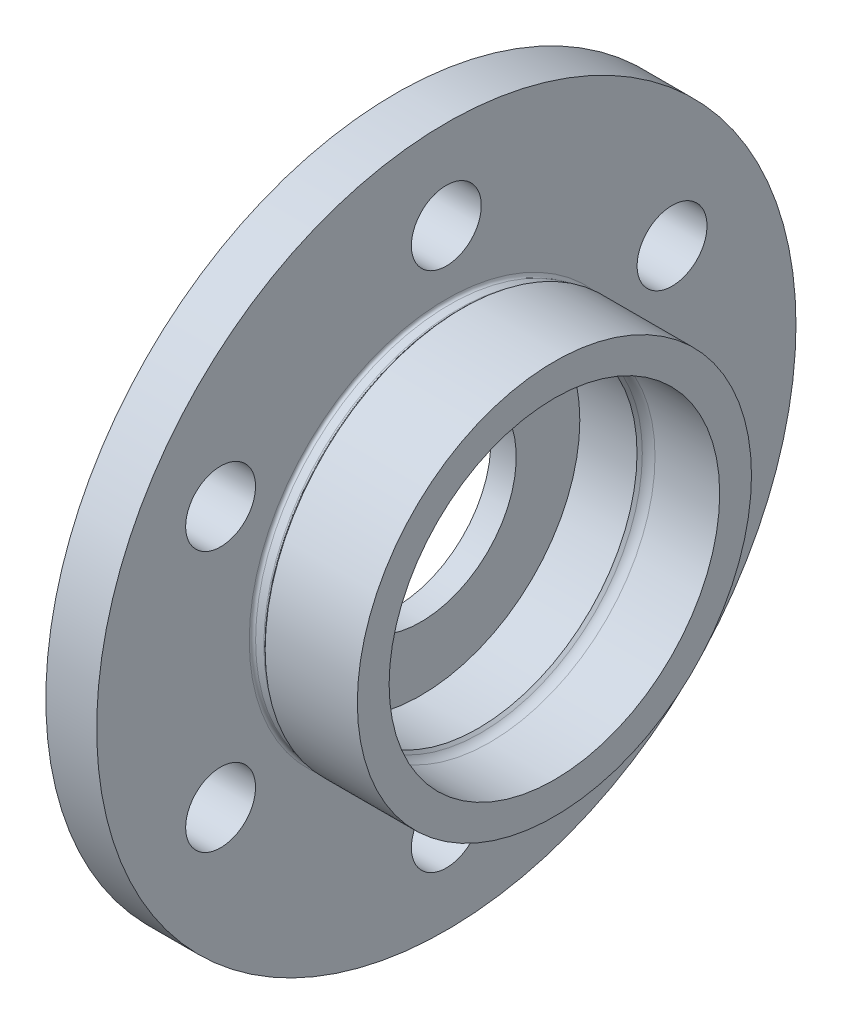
ISO-10303-21;
HEADER;
FILE_DESCRIPTION(('STEP AP214'),'2;1');
FILE_NAME('part.step','',(''),(''),'','','');
FILE_SCHEMA(('AUTOMOTIVE_DESIGN { 1 0 10303 214 1 1 1 1 }'));
ENDSEC;
DATA;
#1=APPLICATION_CONTEXT('core data for automotive mechanical design processes');
#2=APPLICATION_PROTOCOL_DEFINITION('international standard','automotive_design',2000,#1);
#3=PRODUCT_CONTEXT('',#1,'mechanical');
#4=PRODUCT('Part','Part','',(#3));
#5=PRODUCT_RELATED_PRODUCT_CATEGORY('part','',(#4));
#6=PRODUCT_DEFINITION_FORMATION('','',#4);
#7=PRODUCT_DEFINITION_CONTEXT('part definition',#1,'design');
#8=PRODUCT_DEFINITION('design','',#6,#7);
#9=PRODUCT_DEFINITION_SHAPE('','',#8);
#10=(LENGTH_UNIT() NAMED_UNIT(*) SI_UNIT(.MILLI.,.METRE.));
#11=(NAMED_UNIT(*) PLANE_ANGLE_UNIT() SI_UNIT($,.RADIAN.));
#12=(NAMED_UNIT(*) SI_UNIT($,.STERADIAN.) SOLID_ANGLE_UNIT());
#13=UNCERTAINTY_MEASURE_WITH_UNIT(LENGTH_MEASURE(1.E-05),#10,'distance_accuracy_value','');
#14=(GEOMETRIC_REPRESENTATION_CONTEXT(3) GLOBAL_UNCERTAINTY_ASSIGNED_CONTEXT((#13)) GLOBAL_UNIT_ASSIGNED_CONTEXT((#10,
#11,#12)) REPRESENTATION_CONTEXT('',''));
#15=CARTESIAN_POINT('',(0.,0.,0.));
#16=DIRECTION('',(0.,0.,1.));
#17=DIRECTION('',(1.,0.,0.));
#18=AXIS2_PLACEMENT_3D('',#15,#16,#17);
#19=CARTESIAN_POINT('',(4.,-19.6334419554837,0.));
#20=DIRECTION('',(-1.,0.,0.));
#21=DIRECTION('',(0.,0.,1.));
#22=AXIS2_PLACEMENT_3D('',#19,#20,#21);
#23=PLANE('',#22);
#24=CARTESIAN_POINT('',(4.,0.,0.));
#25=DIRECTION('',(-1.,0.,0.));
#26=DIRECTION('',(0.,0.,1.));
#27=AXIS2_PLACEMENT_3D('',#24,#25,#26);
#28=CIRCLE('',#27,15.);
#29=CARTESIAN_POINT('',(4.,0.,15.));
#30=VERTEX_POINT('',#29);
#31=EDGE_CURVE('E113',#30,#30,#28,.F.);
#32=ORIENTED_EDGE('',*,*,#31,.F.);
#33=EDGE_LOOP('',(#32));
#34=FACE_BOUND('',#33,.T.);
#35=CARTESIAN_POINT('',(4.,0.,0.));
#36=DIRECTION('',(1.,0.,0.));
#37=DIRECTION('',(0.,0.,-1.));
#38=AXIS2_PLACEMENT_3D('',#35,#36,#37);
#39=CIRCLE('',#38,25.);
#40=CARTESIAN_POINT('',(4.,0.,-25.));
#41=VERTEX_POINT('',#40);
#42=EDGE_CURVE('E59',#41,#41,#39,.T.);
#43=ORIENTED_EDGE('',*,*,#42,.T.);
#44=EDGE_LOOP('',(#43));
#45=FACE_BOUND('',#44,.T.);
#46=ADVANCED_FACE('F30',(#34,#45),#23,.F.);
#47=CARTESIAN_POINT('',(29.9069920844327,0.,0.));
#48=DIRECTION('',(1.,0.,0.));
#49=DIRECTION('',(0.,0.,-1.));
#50=AXIS2_PLACEMENT_3D('',#47,#48,#49);
#51=CYLINDRICAL_SURFACE('',#50,25.);
#52=CARTESIAN_POINT('',(13.,0.,0.));
#53=DIRECTION('',(-1.,0.,0.));
#54=DIRECTION('',(0.,0.,1.));
#55=AXIS2_PLACEMENT_3D('',#52,#53,#54);
#56=CIRCLE('',#55,25.);
#57=CARTESIAN_POINT('',(13.,0.,25.));
#58=VERTEX_POINT('',#57);
#59=EDGE_CURVE('E41',#58,#58,#56,.F.);
#60=ORIENTED_EDGE('',*,*,#59,.T.);
#61=EDGE_LOOP('',(#60));
#62=FACE_BOUND('',#61,.T.);
#63=ORIENTED_EDGE('',*,*,#42,.F.);
#64=EDGE_LOOP('',(#63));
#65=FACE_BOUND('',#64,.T.);
#66=ADVANCED_FACE('F155',(#62,#65),#51,.F.);
#67=CARTESIAN_POINT('',(29.9069920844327,0.,0.));
#68=DIRECTION('',(1.,0.,0.));
#69=DIRECTION('',(0.,0.,-1.));
#70=AXIS2_PLACEMENT_3D('',#67,#68,#69);
#71=CYLINDRICAL_SURFACE('',#70,26.);
#72=CARTESIAN_POINT('',(14.8284271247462,0.,0.));
#73=DIRECTION('',(1.,0.,0.));
#74=DIRECTION('',(0.,0.,-1.));
#75=AXIS2_PLACEMENT_3D('',#72,#73,#74);
#76=CIRCLE('',#75,26.);
#77=CARTESIAN_POINT('',(14.8284271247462,0.,-26.));
#78=VERTEX_POINT('',#77);
#79=EDGE_CURVE('E10',#78,#78,#76,.F.);
#80=ORIENTED_EDGE('',*,*,#79,.T.);
#81=EDGE_LOOP('',(#80));
#82=FACE_BOUND('',#81,.T.);
#83=CARTESIAN_POINT('',(25.,0.,0.));
#84=DIRECTION('',(1.,0.,0.));
#85=DIRECTION('',(0.,0.,-1.));
#86=AXIS2_PLACEMENT_3D('',#83,#84,#85);
#87=CIRCLE('',#86,26.);
#88=CARTESIAN_POINT('',(25.,0.,-26.));
#89=VERTEX_POINT('',#88);
#90=EDGE_CURVE('E62',#89,#89,#87,.T.);
#91=ORIENTED_EDGE('',*,*,#90,.T.);
#92=EDGE_LOOP('',(#91));
#93=FACE_BOUND('',#92,.T.);
#94=ADVANCED_FACE('F161',(#82,#93),#71,.F.);
#95=CARTESIAN_POINT('',(25.,-19.6334419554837,0.));
#96=DIRECTION('',(-1.,0.,0.));
#97=DIRECTION('',(0.,0.,1.));
#98=AXIS2_PLACEMENT_3D('',#95,#96,#97);
#99=PLANE('',#98);
#100=ORIENTED_EDGE('',*,*,#90,.F.);
#101=EDGE_LOOP('',(#100));
#102=FACE_BOUND('',#101,.T.);
#103=CARTESIAN_POINT('',(25.,0.,0.));
#104=DIRECTION('',(1.,0.,0.));
#105=DIRECTION('',(0.,0.,-1.));
#106=AXIS2_PLACEMENT_3D('',#103,#104,#105);
#107=CIRCLE('',#106,31.);
#108=CARTESIAN_POINT('',(25.,0.,-31.));
#109=VERTEX_POINT('',#108);
#110=EDGE_CURVE('E65',#109,#109,#107,.T.);
#111=ORIENTED_EDGE('',*,*,#110,.T.);
#112=EDGE_LOOP('',(#111));
#113=FACE_BOUND('',#112,.T.);
#114=ADVANCED_FACE('F223',(#102,#113),#99,.F.);
#115=CARTESIAN_POINT('',(29.9069920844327,0.,0.));
#116=DIRECTION('',(1.,0.,0.));
#117=DIRECTION('',(0.,0.,-1.));
#118=AXIS2_PLACEMENT_3D('',#115,#116,#117);
#119=CYLINDRICAL_SURFACE('',#118,31.);
#120=CARTESIAN_POINT('',(10.5,0.,0.));
#121=DIRECTION('',(1.,0.,0.));
#122=DIRECTION('',(0.,0.,-1.));
#123=AXIS2_PLACEMENT_3D('',#120,#121,#122);
#124=CIRCLE('',#123,31.);
#125=CARTESIAN_POINT('',(10.5,0.,-31.));
#126=VERTEX_POINT('',#125);
#127=EDGE_CURVE('E74',#126,#126,#124,.T.);
#128=ORIENTED_EDGE('',*,*,#127,.T.);
#129=EDGE_LOOP('',(#128));
#130=FACE_BOUND('',#129,.T.);
#131=ORIENTED_EDGE('',*,*,#110,.F.);
#132=EDGE_LOOP('',(#131));
#133=FACE_BOUND('',#132,.T.);
#134=ADVANCED_FACE('F218',(#130,#133),#119,.T.);
#135=CARTESIAN_POINT('',(36.050630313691,0.,0.));
#136=DIRECTION('',(1.,0.,0.));
#137=DIRECTION('',(0.,0.,-1.));
#138=AXIS2_PLACEMENT_3D('',#135,#136,#137);
#139=CYLINDRICAL_SURFACE('',#138,30.5);
#140=CARTESIAN_POINT('',(8.5,0.,0.));
#141=DIRECTION('',(-1.,0.,0.));
#142=DIRECTION('',(0.,0.,1.));
#143=AXIS2_PLACEMENT_3D('',#140,#141,#142);
#144=CIRCLE('',#143,30.5);
#145=CARTESIAN_POINT('',(8.5,0.,30.5));
#146=VERTEX_POINT('',#145);
#147=EDGE_CURVE('E53',#146,#146,#144,.F.);
#148=ORIENTED_EDGE('',*,*,#147,.T.);
#149=EDGE_LOOP('',(#148));
#150=FACE_BOUND('',#149,.T.);
#151=CARTESIAN_POINT('',(9.79289321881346,0.,0.));
#152=DIRECTION('',(1.,0.,0.));
#153=DIRECTION('',(0.,0.,-1.));
#154=AXIS2_PLACEMENT_3D('',#151,#152,#153);
#155=CIRCLE('',#154,30.5);
#156=CARTESIAN_POINT('',(9.79289321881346,0.,-30.5));
#157=VERTEX_POINT('',#156);
#158=EDGE_CURVE('E56',#157,#157,#155,.F.);
#159=ORIENTED_EDGE('',*,*,#158,.T.);
#160=EDGE_LOOP('',(#159));
#161=FACE_BOUND('',#160,.T.);
#162=ADVANCED_FACE('F215',(#150,#161),#139,.T.);
#163=CARTESIAN_POINT('',(10.,0.,0.));
#164=DIRECTION('',(1.,0.,0.));
#165=DIRECTION('',(0.,0.,-1.));
#166=AXIS2_PLACEMENT_3D('',#163,#164,#165);
#167=CONICAL_SURFACE('',#166,30.5,0.785398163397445);
#168=CARTESIAN_POINT('',(10.1464466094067,0.,0.));
#169=DIRECTION('',(1.,0.,0.));
#170=DIRECTION('',(0.,0.,-1.));
#171=AXIS2_PLACEMENT_3D('',#168,#169,#170);
#172=CIRCLE('',#171,30.6464466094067);
#173=CARTESIAN_POINT('',(10.1464466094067,0.,-30.6464466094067));
#174=VERTEX_POINT('',#173);
#175=EDGE_CURVE('E45',#174,#174,#172,.T.);
#176=ORIENTED_EDGE('',*,*,#175,.T.);
#177=EDGE_LOOP('',(#176));
#178=FACE_BOUND('',#177,.T.);
#179=ORIENTED_EDGE('',*,*,#127,.F.);
#180=EDGE_LOOP('',(#179));
#181=FACE_BOUND('',#180,.T.);
#182=ADVANCED_FACE('F127',(#178,#181),#167,.T.);
#183=CARTESIAN_POINT('',(0.,-19.6334419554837,0.));
#184=DIRECTION('',(1.,0.,0.));
#185=DIRECTION('',(0.,0.,-1.));
#186=AXIS2_PLACEMENT_3D('',#183,#184,#185);
#187=PLANE('',#186);
#188=CARTESIAN_POINT('',(0.,0.,0.));
#189=DIRECTION('',(-1.,0.,0.));
#190=DIRECTION('',(0.,0.,1.));
#191=AXIS2_PLACEMENT_3D('',#188,#189,#190);
#192=CIRCLE('',#191,15.);
#193=CARTESIAN_POINT('',(0.,0.,15.));
#194=VERTEX_POINT('',#193);
#195=EDGE_CURVE('E116',#194,#194,#192,.T.);
#196=ORIENTED_EDGE('',*,*,#195,.F.);
#197=EDGE_LOOP('',(#196));
#198=FACE_BOUND('',#197,.T.);
#199=CARTESIAN_POINT('',(0.,20.5000000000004,-35.5070415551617));
#200=DIRECTION('',(-1.,0.,0.));
#201=DIRECTION('',(0.,0.866025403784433,0.50000000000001));
#202=AXIS2_PLACEMENT_3D('',#199,#200,#201);
#203=CIRCLE('',#202,5.5);
#204=CARTESIAN_POINT('',(0.,25.2631397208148,-32.7570415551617));
#205=VERTEX_POINT('',#204);
#206=EDGE_CURVE('E110',#205,#205,#203,.T.);
#207=ORIENTED_EDGE('',*,*,#206,.F.);
#208=EDGE_LOOP('',(#207));
#209=FACE_BOUND('',#208,.T.);
#210=CARTESIAN_POINT('',(0.,-20.4999999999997,-35.5070415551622));
#211=DIRECTION('',(-1.,0.,0.));
#212=DIRECTION('',(0.,0.866025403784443,-0.499999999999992));
#213=AXIS2_PLACEMENT_3D('',#210,#211,#212);
#214=CIRCLE('',#213,5.5);
#215=CARTESIAN_POINT('',(0.,-15.7368602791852,-38.2570415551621));
#216=VERTEX_POINT('',#215);
#217=EDGE_CURVE('E104',#216,#216,#214,.T.);
#218=ORIENTED_EDGE('',*,*,#217,.F.);
#219=EDGE_LOOP('',(#218));
#220=FACE_BOUND('',#219,.T.);
#221=CARTESIAN_POINT('',(0.,-41.,-2.86301635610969E-13));
#222=DIRECTION('',(-1.,0.,0.));
#223=DIRECTION('',(0.,0.,-1.));
#224=AXIS2_PLACEMENT_3D('',#221,#222,#223);
#225=CIRCLE('',#224,5.5);
#226=CARTESIAN_POINT('',(0.,-41.,-5.50000000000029));
#227=VERTEX_POINT('',#226);
#228=EDGE_CURVE('E98',#227,#227,#225,.T.);
#229=ORIENTED_EDGE('',*,*,#228,.F.);
#230=EDGE_LOOP('',(#229));
#231=FACE_BOUND('',#230,.T.);
#232=CARTESIAN_POINT('',(0.,-20.5000000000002,35.5070415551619));
#233=DIRECTION('',(-1.,0.,0.));
#234=DIRECTION('',(0.,-0.866025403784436,-0.500000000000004));
#235=AXIS2_PLACEMENT_3D('',#232,#233,#234);
#236=CIRCLE('',#235,5.5);
#237=CARTESIAN_POINT('',(0.,-25.2631397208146,32.7570415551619));
#238=VERTEX_POINT('',#237);
#239=EDGE_CURVE('E92',#238,#238,#236,.T.);
#240=ORIENTED_EDGE('',*,*,#239,.F.);
#241=EDGE_LOOP('',(#240));
#242=FACE_BOUND('',#241,.T.);
#243=CARTESIAN_POINT('',(0.,20.4999999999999,35.507041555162));
#244=DIRECTION('',(-1.,0.,0.));
#245=DIRECTION('',(0.,-0.86602540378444,0.499999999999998));
#246=AXIS2_PLACEMENT_3D('',#243,#244,#245);
#247=CIRCLE('',#246,5.5);
#248=CARTESIAN_POINT('',(0.,15.7368602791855,38.257041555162));
#249=VERTEX_POINT('',#248);
#250=EDGE_CURVE('E86',#249,#249,#247,.T.);
#251=ORIENTED_EDGE('',*,*,#250,.F.);
#252=EDGE_LOOP('',(#251));
#253=FACE_BOUND('',#252,.T.);
#254=CARTESIAN_POINT('',(0.,41.,0.));
#255=DIRECTION('',(-1.,0.,0.));
#256=DIRECTION('',(0.,0.,1.));
#257=AXIS2_PLACEMENT_3D('',#254,#255,#256);
#258=CIRCLE('',#257,5.5);
#259=CARTESIAN_POINT('',(0.,41.,5.5));
#260=VERTEX_POINT('',#259);
#261=EDGE_CURVE('E80',#260,#260,#258,.T.);
#262=ORIENTED_EDGE('',*,*,#261,.F.);
#263=EDGE_LOOP('',(#262));
#264=FACE_BOUND('',#263,.T.);
#265=CARTESIAN_POINT('',(0.,0.,0.));
#266=DIRECTION('',(1.,0.,0.));
#267=DIRECTION('',(0.,0.,-1.));
#268=AXIS2_PLACEMENT_3D('',#265,#266,#267);
#269=CIRCLE('',#268,55.);
#270=CARTESIAN_POINT('',(0.,0.,-55.));
#271=VERTEX_POINT('',#270);
#272=EDGE_CURVE('E71',#271,#271,#269,.T.);
#273=ORIENTED_EDGE('',*,*,#272,.F.);
#274=EDGE_LOOP('',(#273));
#275=FACE_BOUND('',#274,.T.);
#276=ADVANCED_FACE('F123',(#198,#209,#220,#231,#242,#253,#264,#275),#187,.F.);
#277=CARTESIAN_POINT('',(29.9069920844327,0.,0.));
#278=DIRECTION('',(1.,0.,0.));
#279=DIRECTION('',(0.,0.,-1.));
#280=AXIS2_PLACEMENT_3D('',#277,#278,#279);
#281=CYLINDRICAL_SURFACE('',#280,55.);
#282=CARTESIAN_POINT('',(8.,0.,0.));
#283=DIRECTION('',(1.,0.,0.));
#284=DIRECTION('',(0.,0.,-1.));
#285=AXIS2_PLACEMENT_3D('',#282,#283,#284);
#286=CIRCLE('',#285,55.);
#287=CARTESIAN_POINT('',(8.,0.,-55.));
#288=VERTEX_POINT('',#287);
#289=EDGE_CURVE('E68',#288,#288,#286,.T.);
#290=ORIENTED_EDGE('',*,*,#289,.F.);
#291=EDGE_LOOP('',(#290));
#292=FACE_BOUND('',#291,.T.);
#293=ORIENTED_EDGE('',*,*,#272,.T.);
#294=EDGE_LOOP('',(#293));
#295=FACE_BOUND('',#294,.T.);
#296=ADVANCED_FACE('F126',(#292,#295),#281,.T.);
#297=CARTESIAN_POINT('',(8.,-19.6334419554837,0.));
#298=DIRECTION('',(-1.,0.,0.));
#299=DIRECTION('',(0.,0.,1.));
#300=AXIS2_PLACEMENT_3D('',#297,#298,#299);
#301=PLANE('',#300);
#302=CARTESIAN_POINT('',(8.,20.5000000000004,-35.5070415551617));
#303=DIRECTION('',(-1.,0.,0.));
#304=DIRECTION('',(0.,0.,1.));
#305=AXIS2_PLACEMENT_3D('',#302,#303,#304);
#306=CIRCLE('',#305,5.5);
#307=CARTESIAN_POINT('',(8.,20.5000000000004,-30.0070415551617));
#308=VERTEX_POINT('',#307);
#309=EDGE_CURVE('E107',#308,#308,#306,.F.);
#310=ORIENTED_EDGE('',*,*,#309,.F.);
#311=EDGE_LOOP('',(#310));
#312=FACE_BOUND('',#311,.T.);
#313=CARTESIAN_POINT('',(8.,-20.4999999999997,-35.5070415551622));
#314=DIRECTION('',(-1.,0.,0.));
#315=DIRECTION('',(0.,0.,1.));
#316=AXIS2_PLACEMENT_3D('',#313,#314,#315);
#317=CIRCLE('',#316,5.5);
#318=CARTESIAN_POINT('',(8.,-20.4999999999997,-30.0070415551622));
#319=VERTEX_POINT('',#318);
#320=EDGE_CURVE('E101',#319,#319,#317,.F.);
#321=ORIENTED_EDGE('',*,*,#320,.F.);
#322=EDGE_LOOP('',(#321));
#323=FACE_BOUND('',#322,.T.);
#324=CARTESIAN_POINT('',(8.,-41.,-2.86301635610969E-13));
#325=DIRECTION('',(-1.,0.,0.));
#326=DIRECTION('',(0.,0.,1.));
#327=AXIS2_PLACEMENT_3D('',#324,#325,#326);
#328=CIRCLE('',#327,5.5);
#329=CARTESIAN_POINT('',(8.,-41.,5.49999999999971));
#330=VERTEX_POINT('',#329);
#331=EDGE_CURVE('E95',#330,#330,#328,.F.);
#332=ORIENTED_EDGE('',*,*,#331,.F.);
#333=EDGE_LOOP('',(#332));
#334=FACE_BOUND('',#333,.T.);
#335=CARTESIAN_POINT('',(8.,-20.5000000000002,35.5070415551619));
#336=DIRECTION('',(-1.,0.,0.));
#337=DIRECTION('',(0.,0.,1.));
#338=AXIS2_PLACEMENT_3D('',#335,#336,#337);
#339=CIRCLE('',#338,5.5);
#340=CARTESIAN_POINT('',(8.,-20.5000000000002,41.0070415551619));
#341=VERTEX_POINT('',#340);
#342=EDGE_CURVE('E89',#341,#341,#339,.F.);
#343=ORIENTED_EDGE('',*,*,#342,.F.);
#344=EDGE_LOOP('',(#343));
#345=FACE_BOUND('',#344,.T.);
#346=CARTESIAN_POINT('',(8.,20.4999999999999,35.507041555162));
#347=DIRECTION('',(-1.,0.,0.));
#348=DIRECTION('',(0.,0.,1.));
#349=AXIS2_PLACEMENT_3D('',#346,#347,#348);
#350=CIRCLE('',#349,5.5);
#351=CARTESIAN_POINT('',(8.,20.4999999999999,41.007041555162));
#352=VERTEX_POINT('',#351);
#353=EDGE_CURVE('E83',#352,#352,#350,.F.);
#354=ORIENTED_EDGE('',*,*,#353,.F.);
#355=EDGE_LOOP('',(#354));
#356=FACE_BOUND('',#355,.T.);
#357=CARTESIAN_POINT('',(8.,41.,0.));
#358=DIRECTION('',(-1.,0.,0.));
#359=DIRECTION('',(0.,0.,1.));
#360=AXIS2_PLACEMENT_3D('',#357,#358,#359);
#361=CIRCLE('',#360,5.5);
#362=CARTESIAN_POINT('',(8.,41.,5.5));
#363=VERTEX_POINT('',#362);
#364=EDGE_CURVE('E77',#363,#363,#361,.F.);
#365=ORIENTED_EDGE('',*,*,#364,.F.);
#366=EDGE_LOOP('',(#365));
#367=FACE_BOUND('',#366,.T.);
#368=CARTESIAN_POINT('',(8.,0.,0.));
#369=DIRECTION('',(-1.,0.,0.));
#370=DIRECTION('',(0.,0.,1.));
#371=AXIS2_PLACEMENT_3D('',#368,#369,#370);
#372=CIRCLE('',#371,31.);
#373=CARTESIAN_POINT('',(8.,0.,31.));
#374=VERTEX_POINT('',#373);
#375=EDGE_CURVE('E50',#374,#374,#372,.T.);
#376=ORIENTED_EDGE('',*,*,#375,.T.);
#377=EDGE_LOOP('',(#376));
#378=FACE_BOUND('',#377,.T.);
#379=ORIENTED_EDGE('',*,*,#289,.T.);
#380=EDGE_LOOP('',(#379));
#381=FACE_BOUND('',#380,.T.);
#382=ADVANCED_FACE('F144',(#312,#323,#334,#345,#356,#367,#378,#381),#301,.F.);
#383=CARTESIAN_POINT('',(8.5,0.,0.));
#384=DIRECTION('',(-1.,0.,0.));
#385=DIRECTION('',(0.,0.,1.));
#386=AXIS2_PLACEMENT_3D('',#383,#384,#385);
#387=TOROIDAL_SURFACE('',#386,31.,0.5);
#388=ORIENTED_EDGE('',*,*,#375,.F.);
#389=EDGE_LOOP('',(#388));
#390=FACE_BOUND('',#389,.T.);
#391=ORIENTED_EDGE('',*,*,#147,.F.);
#392=EDGE_LOOP('',(#391));
#393=FACE_BOUND('',#392,.T.);
#394=ADVANCED_FACE('F150',(#390,#393),#387,.F.);
#395=CARTESIAN_POINT('',(9.79289321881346,0.,0.));
#396=DIRECTION('',(1.,0.,0.));
#397=DIRECTION('',(0.,0.,-1.));
#398=AXIS2_PLACEMENT_3D('',#395,#396,#397);
#399=TOROIDAL_SURFACE('',#398,31.,0.5);
#400=ORIENTED_EDGE('',*,*,#158,.F.);
#401=EDGE_LOOP('',(#400));
#402=FACE_BOUND('',#401,.T.);
#403=ORIENTED_EDGE('',*,*,#175,.F.);
#404=EDGE_LOOP('',(#403));
#405=FACE_BOUND('',#404,.T.);
#406=ADVANCED_FACE('F170',(#402,#405),#399,.F.);
#407=CARTESIAN_POINT('',(25.001,41.,0.));
#408=DIRECTION('',(-1.,0.,0.));
#409=DIRECTION('',(0.,0.,1.));
#410=AXIS2_PLACEMENT_3D('',#407,#408,#409);
#411=CYLINDRICAL_SURFACE('',#410,5.5);
#412=ORIENTED_EDGE('',*,*,#261,.T.);
#413=EDGE_LOOP('',(#412));
#414=FACE_BOUND('',#413,.T.);
#415=ORIENTED_EDGE('',*,*,#364,.T.);
#416=EDGE_LOOP('',(#415));
#417=FACE_BOUND('',#416,.T.);
#418=ADVANCED_FACE('F173',(#414,#417),#411,.F.);
#419=CARTESIAN_POINT('',(25.001,20.4999999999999,35.507041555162));
#420=DIRECTION('',(-1.,0.,0.));
#421=DIRECTION('',(0.,0.,1.));
#422=AXIS2_PLACEMENT_3D('',#419,#420,#421);
#423=CYLINDRICAL_SURFACE('',#422,5.5);
#424=ORIENTED_EDGE('',*,*,#250,.T.);
#425=EDGE_LOOP('',(#424));
#426=FACE_BOUND('',#425,.T.);
#427=ORIENTED_EDGE('',*,*,#353,.T.);
#428=EDGE_LOOP('',(#427));
#429=FACE_BOUND('',#428,.T.);
#430=ADVANCED_FACE('F205',(#426,#429),#423,.F.);
#431=CARTESIAN_POINT('',(25.001,-20.5000000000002,35.5070415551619));
#432=DIRECTION('',(-1.,0.,0.));
#433=DIRECTION('',(0.,0.,1.));
#434=AXIS2_PLACEMENT_3D('',#431,#432,#433);
#435=CYLINDRICAL_SURFACE('',#434,5.5);
#436=ORIENTED_EDGE('',*,*,#239,.T.);
#437=EDGE_LOOP('',(#436));
#438=FACE_BOUND('',#437,.T.);
#439=ORIENTED_EDGE('',*,*,#342,.T.);
#440=EDGE_LOOP('',(#439));
#441=FACE_BOUND('',#440,.T.);
#442=ADVANCED_FACE('F201',(#438,#441),#435,.F.);
#443=CARTESIAN_POINT('',(25.001,-41.,-2.86301635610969E-13));
#444=DIRECTION('',(-1.,0.,0.));
#445=DIRECTION('',(0.,0.,1.));
#446=AXIS2_PLACEMENT_3D('',#443,#444,#445);
#447=CYLINDRICAL_SURFACE('',#446,5.5);
#448=ORIENTED_EDGE('',*,*,#228,.T.);
#449=EDGE_LOOP('',(#448));
#450=FACE_BOUND('',#449,.T.);
#451=ORIENTED_EDGE('',*,*,#331,.T.);
#452=EDGE_LOOP('',(#451));
#453=FACE_BOUND('',#452,.T.);
#454=ADVANCED_FACE('F193',(#450,#453),#447,.F.);
#455=CARTESIAN_POINT('',(25.001,-20.4999999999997,-35.5070415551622));
#456=DIRECTION('',(-1.,0.,0.));
#457=DIRECTION('',(0.,0.,1.));
#458=AXIS2_PLACEMENT_3D('',#455,#456,#457);
#459=CYLINDRICAL_SURFACE('',#458,5.5);
#460=ORIENTED_EDGE('',*,*,#217,.T.);
#461=EDGE_LOOP('',(#460));
#462=FACE_BOUND('',#461,.T.);
#463=ORIENTED_EDGE('',*,*,#320,.T.);
#464=EDGE_LOOP('',(#463));
#465=FACE_BOUND('',#464,.T.);
#466=ADVANCED_FACE('F183',(#462,#465),#459,.F.);
#467=CARTESIAN_POINT('',(25.001,20.5000000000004,-35.5070415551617));
#468=DIRECTION('',(-1.,0.,0.));
#469=DIRECTION('',(0.,0.,1.));
#470=AXIS2_PLACEMENT_3D('',#467,#468,#469);
#471=CYLINDRICAL_SURFACE('',#470,5.5);
#472=ORIENTED_EDGE('',*,*,#206,.T.);
#473=EDGE_LOOP('',(#472));
#474=FACE_BOUND('',#473,.T.);
#475=ORIENTED_EDGE('',*,*,#309,.T.);
#476=EDGE_LOOP('',(#475));
#477=FACE_BOUND('',#476,.T.);
#478=ADVANCED_FACE('F177',(#474,#477),#471,.F.);
#479=CARTESIAN_POINT('',(13.,0.,0.));
#480=DIRECTION('',(1.,0.,0.));
#481=DIRECTION('',(0.,0.,-1.));
#482=AXIS2_PLACEMENT_3D('',#479,#480,#481);
#483=CONICAL_SURFACE('',#482,25.,0.785398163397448);
#484=CARTESIAN_POINT('',(13.4142135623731,0.,0.));
#485=DIRECTION('',(-1.,0.,0.));
#486=DIRECTION('',(0.,0.,1.));
#487=AXIS2_PLACEMENT_3D('',#484,#485,#486);
#488=CIRCLE('',#487,25.4142135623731);
#489=CARTESIAN_POINT('',(13.4142135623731,0.,25.4142135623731));
#490=VERTEX_POINT('',#489);
#491=EDGE_CURVE('E37',#490,#490,#488,.F.);
#492=ORIENTED_EDGE('',*,*,#491,.T.);
#493=EDGE_LOOP('',(#492));
#494=FACE_BOUND('',#493,.T.);
#495=ORIENTED_EDGE('',*,*,#59,.F.);
#496=EDGE_LOOP('',(#495));
#497=FACE_BOUND('',#496,.T.);
#498=ADVANCED_FACE('F175',(#494,#497),#483,.F.);
#499=CARTESIAN_POINT('',(14.8284271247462,0.,0.));
#500=DIRECTION('',(1.,0.,0.));
#501=DIRECTION('',(0.,0.,-1.));
#502=AXIS2_PLACEMENT_3D('',#499,#500,#501);
#503=TOROIDAL_SURFACE('',#502,24.,2.);
#504=ORIENTED_EDGE('',*,*,#79,.F.);
#505=EDGE_LOOP('',(#504));
#506=FACE_BOUND('',#505,.T.);
#507=ORIENTED_EDGE('',*,*,#491,.F.);
#508=EDGE_LOOP('',(#507));
#509=FACE_BOUND('',#508,.T.);
#510=ADVANCED_FACE('F32',(#506,#509),#503,.F.);
#511=CARTESIAN_POINT('',(25.001,0.,0.));
#512=DIRECTION('',(-1.,0.,0.));
#513=DIRECTION('',(0.,0.,1.));
#514=AXIS2_PLACEMENT_3D('',#511,#512,#513);
#515=CYLINDRICAL_SURFACE('',#514,15.);
#516=ORIENTED_EDGE('',*,*,#195,.T.);
#517=EDGE_LOOP('',(#516));
#518=FACE_BOUND('',#517,.T.);
#519=ORIENTED_EDGE('',*,*,#31,.T.);
#520=EDGE_LOOP('',(#519));
#521=FACE_BOUND('',#520,.T.);
#522=ADVANCED_FACE('F120',(#518,#521),#515,.F.);
#523=CLOSED_SHELL('',(#46,#66,#94,#114,#134,#162,#182,#276,#296,#382,#394,#406,#418,#430,#442,
#454,#466,#478,#498,#510,#522));
#524=MANIFOLD_SOLID_BREP('B2',#523);
#525=ADVANCED_BREP_SHAPE_REPRESENTATION('',(#18,#524),#14);
#526=SHAPE_DEFINITION_REPRESENTATION(#9,#525);
ENDSEC;
END-ISO-10303-21;
